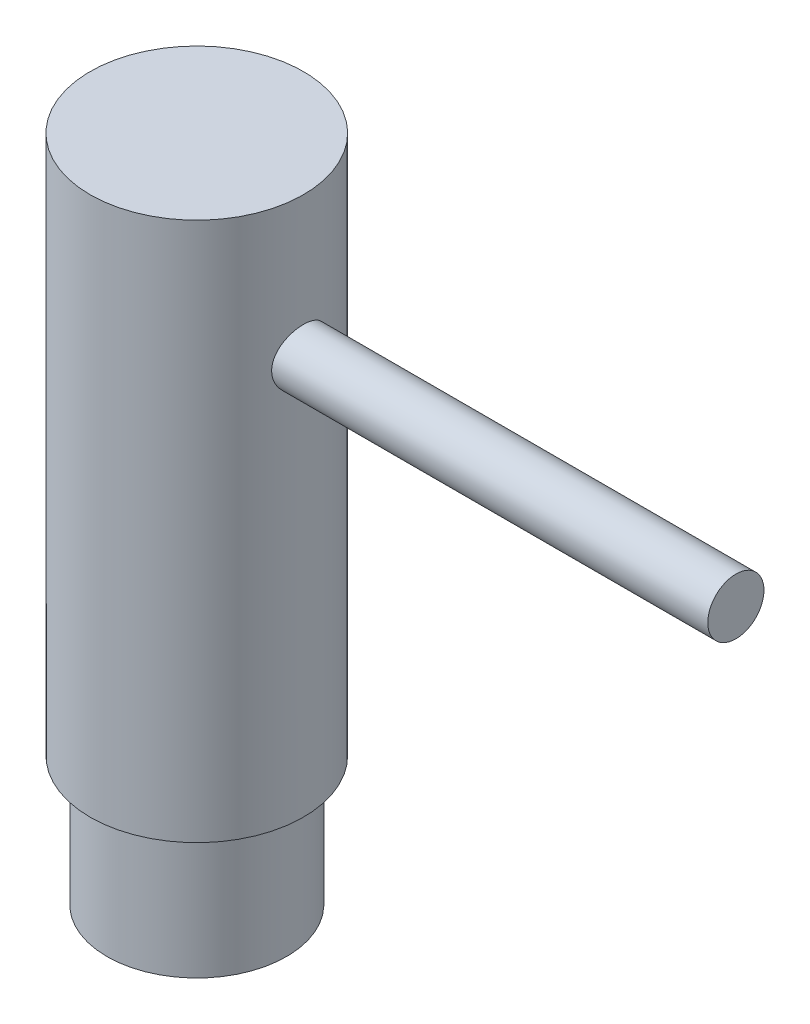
ISO-10303-21;
HEADER;
FILE_DESCRIPTION(('STEP AP214'),'2;1');
FILE_NAME('part.step','',(''),(''),'','','');
FILE_SCHEMA(('AUTOMOTIVE_DESIGN { 1 0 10303 214 1 1 1 1 }'));
ENDSEC;
DATA;
#1=APPLICATION_CONTEXT('core data for automotive mechanical design processes');
#2=APPLICATION_PROTOCOL_DEFINITION('international standard','automotive_design',2000,#1);
#3=PRODUCT_CONTEXT('',#1,'mechanical');
#4=PRODUCT('Part','Part','',(#3));
#5=PRODUCT_RELATED_PRODUCT_CATEGORY('part','',(#4));
#6=PRODUCT_DEFINITION_FORMATION('','',#4);
#7=PRODUCT_DEFINITION_CONTEXT('part definition',#1,'design');
#8=PRODUCT_DEFINITION('design','',#6,#7);
#9=PRODUCT_DEFINITION_SHAPE('','',#8);
#10=(LENGTH_UNIT() NAMED_UNIT(*) SI_UNIT(.MILLI.,.METRE.));
#11=(NAMED_UNIT(*) PLANE_ANGLE_UNIT() SI_UNIT($,.RADIAN.));
#12=(NAMED_UNIT(*) SI_UNIT($,.STERADIAN.) SOLID_ANGLE_UNIT());
#13=UNCERTAINTY_MEASURE_WITH_UNIT(LENGTH_MEASURE(1.E-05),#10,'distance_accuracy_value','');
#14=(GEOMETRIC_REPRESENTATION_CONTEXT(3) GLOBAL_UNCERTAINTY_ASSIGNED_CONTEXT((#13)) GLOBAL_UNIT_ASSIGNED_CONTEXT((#10,
#11,#12)) REPRESENTATION_CONTEXT('',''));
#15=CARTESIAN_POINT('',(0.,0.,0.));
#16=DIRECTION('',(0.,0.,1.));
#17=DIRECTION('',(1.,0.,0.));
#18=AXIS2_PLACEMENT_3D('',#15,#16,#17);
#19=CARTESIAN_POINT('',(0.,119.,0.));
#20=DIRECTION('',(0.,-1.,0.));
#21=DIRECTION('',(0.,0.,-1.));
#22=AXIS2_PLACEMENT_3D('',#19,#20,#21);
#23=CYLINDRICAL_SURFACE('',#22,19.);
#24=CARTESIAN_POINT('',(0.,23.,0.));
#25=DIRECTION('',(0.,1.,0.));
#26=DIRECTION('',(0.,0.,1.));
#27=AXIS2_PLACEMENT_3D('',#24,#25,#26);
#28=CIRCLE('',#27,19.);
#29=CARTESIAN_POINT('',(0.,23.,19.));
#30=VERTEX_POINT('',#29);
#31=EDGE_CURVE('E53',#30,#30,#28,.T.);
#32=ORIENTED_EDGE('',*,*,#31,.T.);
#33=EDGE_LOOP('',(#32));
#34=FACE_BOUND('',#33,.T.);
#35=CARTESIAN_POINT('',(0.,119.,0.));
#36=DIRECTION('',(0.,1.,0.));
#37=DIRECTION('',(0.,0.,1.));
#38=AXIS2_PLACEMENT_3D('',#35,#36,#37);
#39=CIRCLE('',#38,19.);
#40=CARTESIAN_POINT('',(0.,119.,19.));
#41=VERTEX_POINT('',#40);
#42=EDGE_CURVE('E51',#41,#41,#39,.T.);
#43=ORIENTED_EDGE('',*,*,#42,.F.);
#44=EDGE_LOOP('',(#43));
#45=FACE_BOUND('',#44,.T.);
#46=CARTESIAN_POINT('',(18.3303027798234,94.,5.));
#47=CARTESIAN_POINT('',(18.3303076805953,93.7244171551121,4.99999308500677));
#48=CARTESIAN_POINT('',(18.3365854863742,93.4487604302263,4.97713861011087));
#49=CARTESIAN_POINT('',(18.3609456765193,92.9053982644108,4.88649188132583));
#50=CARTESIAN_POINT('',(18.3790341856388,92.6376970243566,4.8186763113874));
#51=CARTESIAN_POINT('',(18.4248284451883,92.1181845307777,4.64048304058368));
#52=CARTESIAN_POINT('',(18.4525209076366,91.8663518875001,4.53016412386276));
#53=CARTESIAN_POINT('',(18.5143859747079,91.3847319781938,4.27027879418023));
#54=CARTESIAN_POINT('',(18.5485590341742,91.1549462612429,4.12070962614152));
#55=CARTESIAN_POINT('',(18.6204675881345,90.7183445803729,3.78267387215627));
#56=CARTESIAN_POINT('',(18.6582649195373,90.5121452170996,3.59342388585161));
#57=CARTESIAN_POINT('',(18.7326289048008,90.1340162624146,3.18308399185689));
#58=CARTESIAN_POINT('',(18.7691954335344,89.9620901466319,2.9619908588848));
#59=CARTESIAN_POINT('',(18.8376665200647,89.6548272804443,2.48997619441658));
#60=CARTESIAN_POINT('',(18.8694896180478,89.5201019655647,2.23864380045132));
#61=CARTESIAN_POINT('',(18.9241795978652,89.2950500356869,1.71591903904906));
#62=CARTESIAN_POINT('',(18.9470479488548,89.2047161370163,1.44452997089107));
#63=CARTESIAN_POINT('',(18.9808145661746,89.07300244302,0.895829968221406));
#64=CARTESIAN_POINT('',(18.9919688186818,89.0305741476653,0.618786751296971));
#65=CARTESIAN_POINT('',(19.0019448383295,88.9925789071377,0.0613051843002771));
#66=CARTESIAN_POINT('',(19.0007686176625,88.9970043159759,-0.219132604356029));
#67=CARTESIAN_POINT('',(18.9864044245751,89.0518491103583,-0.768150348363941));
#68=CARTESIAN_POINT('',(18.9735122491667,89.1011359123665,-1.03685236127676));
#69=CARTESIAN_POINT('',(18.9375127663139,89.2424766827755,-1.56202860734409));
#70=CARTESIAN_POINT('',(18.9144048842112,89.3345330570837,-1.81850215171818));
#71=CARTESIAN_POINT('',(18.8601287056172,89.5596782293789,-2.31485231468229));
#72=CARTESIAN_POINT('',(18.8288840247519,89.6931583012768,-2.55454275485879));
#73=CARTESIAN_POINT('',(18.7617056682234,89.9970623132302,-3.00851095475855));
#74=CARTESIAN_POINT('',(18.7257710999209,90.1674932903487,-3.22278386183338));
#75=CARTESIAN_POINT('',(18.651843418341,90.5464863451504,-3.62659371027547));
#76=CARTESIAN_POINT('',(18.6138208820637,90.7560366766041,-3.81519881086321));
#77=CARTESIAN_POINT('',(18.5409756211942,91.2041865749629,-4.15481353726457));
#78=CARTESIAN_POINT('',(18.5061530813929,91.4427878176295,-4.30582099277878));
#79=CARTESIAN_POINT('',(18.4435351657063,91.9442454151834,-4.56663864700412));
#80=CARTESIAN_POINT('',(18.4157822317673,92.2072359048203,-4.67620185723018));
#81=CARTESIAN_POINT('',(18.3709765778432,92.7488153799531,-4.84925751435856));
#82=CARTESIAN_POINT('',(18.3539212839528,93.0274005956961,-4.91276104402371));
#83=CARTESIAN_POINT('',(18.3329885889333,93.5835624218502,-4.99030134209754));
#84=CARTESIAN_POINT('',(18.3287417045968,93.8609319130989,-5.00572550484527));
#85=CARTESIAN_POINT('',(18.3328968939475,94.4142856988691,-4.99048654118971));
#86=CARTESIAN_POINT('',(18.3412976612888,94.6902701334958,-4.95982817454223));
#87=CARTESIAN_POINT('',(18.3694453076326,95.2277160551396,-4.85451613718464));
#88=CARTESIAN_POINT('',(18.38897839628,95.4893521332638,-4.78069079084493));
#89=CARTESIAN_POINT('',(18.4369822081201,95.9965300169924,-4.59206897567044));
#90=CARTESIAN_POINT('',(18.4654540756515,96.2420697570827,-4.47726726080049));
#91=CARTESIAN_POINT('',(18.5288899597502,96.7159055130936,-4.20711613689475));
#92=CARTESIAN_POINT('',(18.5639802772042,96.9437179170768,-4.05094882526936));
#93=CARTESIAN_POINT('',(18.6363994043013,97.3704129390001,-3.70351772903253));
#94=CARTESIAN_POINT('',(18.6737286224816,97.5692902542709,-3.51224752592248));
#95=CARTESIAN_POINT('',(18.7476872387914,97.938198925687,-3.09363353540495));
#96=CARTESIAN_POINT('',(18.7842676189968,98.107264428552,-2.86542821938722));
#97=CARTESIAN_POINT('',(18.8515301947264,98.4046846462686,-2.38306898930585));
#98=CARTESIAN_POINT('',(18.8822127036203,98.5330415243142,-2.12891645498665));
#99=CARTESIAN_POINT('',(18.9340252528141,98.7442346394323,-1.60366333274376));
#100=CARTESIAN_POINT('',(18.9552259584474,98.827408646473,-1.33270586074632));
#101=CARTESIAN_POINT('',(18.9859968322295,98.9468630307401,-0.780020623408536));
#102=CARTESIAN_POINT('',(18.9955695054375,98.983153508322,-0.498295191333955));
#103=CARTESIAN_POINT('',(19.0018908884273,99.0071917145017,0.0588947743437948));
#104=CARTESIAN_POINT('',(18.9990143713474,98.9963580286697,0.334294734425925));
#105=CARTESIAN_POINT('',(18.9816045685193,98.9297396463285,0.879206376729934));
#106=CARTESIAN_POINT('',(18.9670717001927,98.8739565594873,1.14871826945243));
#107=CARTESIAN_POINT('',(18.9280530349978,98.7198163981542,1.67254445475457));
#108=CARTESIAN_POINT('',(18.9036330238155,98.6217404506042,1.92694669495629));
#109=CARTESIAN_POINT('',(18.8473973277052,98.3860502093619,2.41582977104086));
#110=CARTESIAN_POINT('',(18.8155806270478,98.24843048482,2.65030786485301));
#111=CARTESIAN_POINT('',(18.7469251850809,97.9333697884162,3.0993177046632));
#112=CARTESIAN_POINT('',(18.7099770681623,97.7549834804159,3.31316936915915));
#113=CARTESIAN_POINT('',(18.6356759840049,97.3652554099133,3.70838303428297));
#114=CARTESIAN_POINT('',(18.5983229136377,97.1539050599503,3.88973654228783));
#115=CARTESIAN_POINT('',(18.5265290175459,96.6988421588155,4.21861622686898));
#116=CARTESIAN_POINT('',(18.4921669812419,96.4545371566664,4.36534133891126));
#117=CARTESIAN_POINT('',(18.4313463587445,95.9438531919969,4.61542491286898));
#118=CARTESIAN_POINT('',(18.4048824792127,95.6774891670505,4.71881243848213));
#119=CARTESIAN_POINT('',(18.3666293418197,95.1766602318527,4.86534794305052));
#120=CARTESIAN_POINT('',(18.3531154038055,94.9444171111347,4.91572577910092));
#121=CARTESIAN_POINT('',(18.3349504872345,94.4748005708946,4.98305299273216));
#122=CARTESIAN_POINT('',(18.3302985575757,94.2374277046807,5.00000595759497));
#123=CARTESIAN_POINT('',(18.3303027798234,94.,5.));
#124=B_SPLINE_CURVE_WITH_KNOTS('',3,(#46,#47,#48,#49,#50,#51,#52,#53,#54,#55,#56,#57,#58,#59,
#60,#61,#62,#63,#64,#65,#66,#67,#68,#69,#70,#71,#72,#73,#74,#75,#76,#77,#78,#79,#80,#81,#82,#83,
#84,#85,#86,#87,#88,#89,#90,#91,#92,#93,#94,#95,#96,#97,#98,#99,#100,#101,#102,#103,#104,#105,
#106,#107,#108,#109,#110,#111,#112,#113,#114,#115,#116,#117,#118,#119,#120,#121,#122,#123),
.UNSPECIFIED.,.T.,.F.,(4,2,2,2,2,2,2,2,2,2,2,2,2,2,2,2,2,2,2,2,2,2,2,2,2,2,2,2,2,2,2,2,2,2,2,2,
2,2,4),(0.,0.825875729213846,1.65218007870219,2.47734568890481,3.30256923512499,
4.14594894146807,4.98941413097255,5.84601327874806,6.70247183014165,7.53979807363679,
8.37698767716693,9.19361043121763,10.0102791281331,10.8349094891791,11.6596970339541,
12.5091605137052,13.3586730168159,14.2131713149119,15.0674639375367,15.896865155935,
16.7261807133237,17.5400819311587,18.3540873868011,19.1855755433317,20.0172158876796,
20.8721888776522,21.7271164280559,22.5755616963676,23.4238241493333,24.2467308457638,
25.0696080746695,25.8870978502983,26.7046999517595,27.5436351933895,28.3827893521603,
29.2397824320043,30.0961998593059,30.8078073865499,31.5193385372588),.UNSPECIFIED.);
#125=CARTESIAN_POINT('',(18.3303027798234,94.,5.));
#126=VERTEX_POINT('',#125);
#127=EDGE_CURVE('E10',#126,#126,#124,.T.);
#128=ORIENTED_EDGE('',*,*,#127,.F.);
#129=EDGE_LOOP('',(#128));
#130=FACE_BOUND('',#129,.T.);
#131=ADVANCED_FACE('F31',(#34,#45,#130),#23,.T.);
#132=CARTESIAN_POINT('',(0.,23.,0.));
#133=DIRECTION('',(0.,-1.,0.));
#134=DIRECTION('',(0.,0.,-1.));
#135=AXIS2_PLACEMENT_3D('',#132,#133,#134);
#136=CYLINDRICAL_SURFACE('',#135,16.);
#137=CARTESIAN_POINT('',(0.,23.,0.));
#138=DIRECTION('',(0.,1.,0.));
#139=DIRECTION('',(0.,0.,1.));
#140=AXIS2_PLACEMENT_3D('',#137,#138,#139);
#141=CIRCLE('',#140,16.);
#142=CARTESIAN_POINT('',(0.,23.,16.));
#143=VERTEX_POINT('',#142);
#144=EDGE_CURVE('E42',#143,#143,#141,.T.);
#145=ORIENTED_EDGE('',*,*,#144,.F.);
#146=EDGE_LOOP('',(#145));
#147=FACE_BOUND('',#146,.T.);
#148=CARTESIAN_POINT('',(0.,0.,0.));
#149=DIRECTION('',(0.,1.,0.));
#150=DIRECTION('',(0.,0.,1.));
#151=AXIS2_PLACEMENT_3D('',#148,#149,#150);
#152=CIRCLE('',#151,16.);
#153=CARTESIAN_POINT('',(0.,0.,16.));
#154=VERTEX_POINT('',#153);
#155=EDGE_CURVE('E46',#154,#154,#152,.T.);
#156=ORIENTED_EDGE('',*,*,#155,.T.);
#157=EDGE_LOOP('',(#156));
#158=FACE_BOUND('',#157,.T.);
#159=ADVANCED_FACE('F33',(#147,#158),#136,.T.);
#160=CARTESIAN_POINT('',(0.,0.,0.));
#161=DIRECTION('',(0.,1.,0.));
#162=DIRECTION('',(0.,0.,1.));
#163=AXIS2_PLACEMENT_3D('',#160,#161,#162);
#164=PLANE('',#163);
#165=ORIENTED_EDGE('',*,*,#155,.F.);
#166=EDGE_LOOP('',(#165));
#167=FACE_BOUND('',#166,.T.);
#168=ADVANCED_FACE('F81',(#167),#164,.F.);
#169=CARTESIAN_POINT('',(0.,23.,0.));
#170=DIRECTION('',(0.,1.,0.));
#171=DIRECTION('',(0.,0.,1.));
#172=AXIS2_PLACEMENT_3D('',#169,#170,#171);
#173=PLANE('',#172);
#174=ORIENTED_EDGE('',*,*,#31,.F.);
#175=EDGE_LOOP('',(#174));
#176=FACE_BOUND('',#175,.T.);
#177=ORIENTED_EDGE('',*,*,#144,.T.);
#178=EDGE_LOOP('',(#177));
#179=FACE_BOUND('',#178,.T.);
#180=ADVANCED_FACE('F72',(#176,#179),#173,.F.);
#181=CARTESIAN_POINT('',(0.,119.,0.));
#182=DIRECTION('',(0.,1.,0.));
#183=DIRECTION('',(0.,0.,1.));
#184=AXIS2_PLACEMENT_3D('',#181,#182,#183);
#185=PLANE('',#184);
#186=ORIENTED_EDGE('',*,*,#42,.T.);
#187=EDGE_LOOP('',(#186));
#188=FACE_BOUND('',#187,.T.);
#189=ADVANCED_FACE('F66',(#188),#185,.T.);
#190=CARTESIAN_POINT('',(96.,94.,0.));
#191=DIRECTION('',(-1.,0.,0.));
#192=DIRECTION('',(0.,0.,1.));
#193=AXIS2_PLACEMENT_3D('',#190,#191,#192);
#194=CYLINDRICAL_SURFACE('',#193,5.);
#195=CARTESIAN_POINT('',(96.,94.,0.));
#196=DIRECTION('',(1.,0.,0.));
#197=DIRECTION('',(0.,0.,-1.));
#198=AXIS2_PLACEMENT_3D('',#195,#196,#197);
#199=CIRCLE('',#198,5.);
#200=CARTESIAN_POINT('',(96.,94.,-5.));
#201=VERTEX_POINT('',#200);
#202=EDGE_CURVE('E56',#201,#201,#199,.T.);
#203=ORIENTED_EDGE('',*,*,#202,.F.);
#204=EDGE_LOOP('',(#203));
#205=FACE_BOUND('',#204,.T.);
#206=ORIENTED_EDGE('',*,*,#127,.T.);
#207=EDGE_LOOP('',(#206));
#208=FACE_BOUND('',#207,.T.);
#209=ADVANCED_FACE('F64',(#205,#208),#194,.T.);
#210=CARTESIAN_POINT('',(96.,94.,0.));
#211=DIRECTION('',(1.,0.,0.));
#212=DIRECTION('',(0.,0.,-1.));
#213=AXIS2_PLACEMENT_3D('',#210,#211,#212);
#214=PLANE('',#213);
#215=ORIENTED_EDGE('',*,*,#202,.T.);
#216=EDGE_LOOP('',(#215));
#217=FACE_BOUND('',#216,.T.);
#218=ADVANCED_FACE('F62',(#217),#214,.T.);
#219=CLOSED_SHELL('',(#131,#159,#168,#180,#189,#209,#218));
#220=MANIFOLD_SOLID_BREP('B2',#219);
#221=ADVANCED_BREP_SHAPE_REPRESENTATION('',(#18,#220),#14);
#222=SHAPE_DEFINITION_REPRESENTATION(#9,#221);
ENDSEC;
END-ISO-10303-21;
